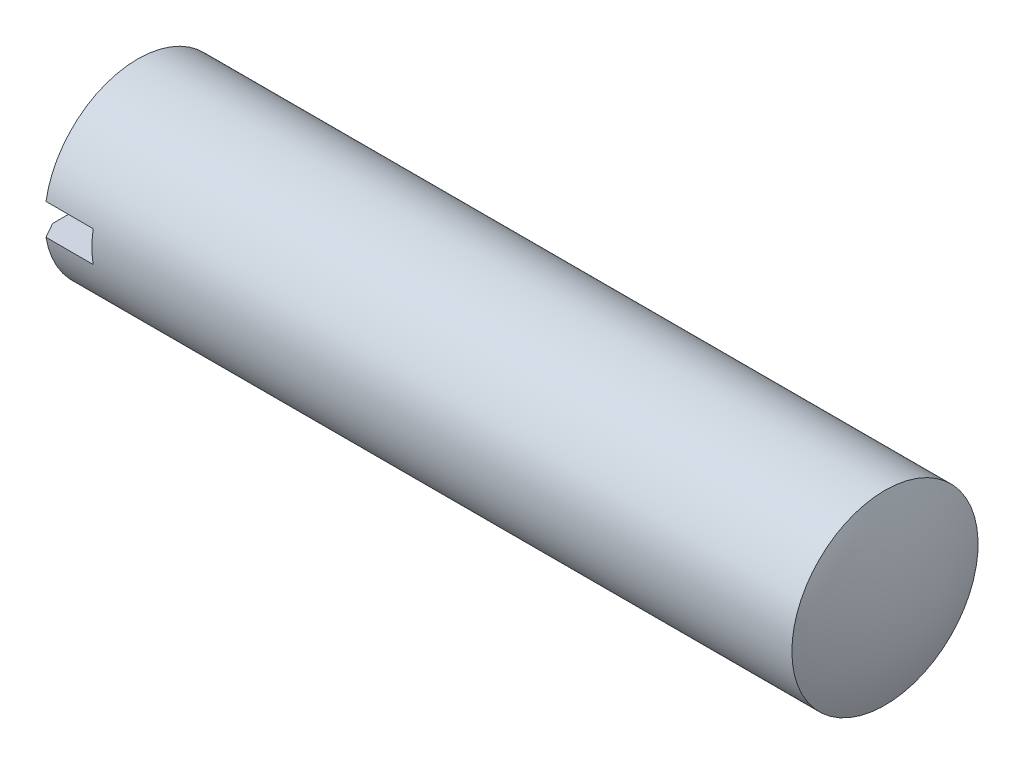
ISO-10303-21;
HEADER;
FILE_DESCRIPTION(('STEP AP214'),'2;1');
FILE_NAME('part.step','',(''),(''),'','','');
FILE_SCHEMA(('AUTOMOTIVE_DESIGN { 1 0 10303 214 1 1 1 1 }'));
ENDSEC;
DATA;
#1=APPLICATION_CONTEXT('core data for automotive mechanical design processes');
#2=APPLICATION_PROTOCOL_DEFINITION('international standard','automotive_design',2000,#1);
#3=PRODUCT_CONTEXT('',#1,'mechanical');
#4=PRODUCT('Part','Part','',(#3));
#5=PRODUCT_RELATED_PRODUCT_CATEGORY('part','',(#4));
#6=PRODUCT_DEFINITION_FORMATION('','',#4);
#7=PRODUCT_DEFINITION_CONTEXT('part definition',#1,'design');
#8=PRODUCT_DEFINITION('design','',#6,#7);
#9=PRODUCT_DEFINITION_SHAPE('','',#8);
#10=(LENGTH_UNIT() NAMED_UNIT(*) SI_UNIT(.MILLI.,.METRE.));
#11=(NAMED_UNIT(*) PLANE_ANGLE_UNIT() SI_UNIT($,.RADIAN.));
#12=(NAMED_UNIT(*) SI_UNIT($,.STERADIAN.) SOLID_ANGLE_UNIT());
#13=UNCERTAINTY_MEASURE_WITH_UNIT(LENGTH_MEASURE(1.E-05),#10,'distance_accuracy_value','');
#14=(GEOMETRIC_REPRESENTATION_CONTEXT(3) GLOBAL_UNCERTAINTY_ASSIGNED_CONTEXT((#13)) GLOBAL_UNIT_ASSIGNED_CONTEXT((#10,
#11,#12)) REPRESENTATION_CONTEXT('',''));
#15=CARTESIAN_POINT('',(0.,0.,0.));
#16=DIRECTION('',(0.,0.,1.));
#17=DIRECTION('',(1.,0.,0.));
#18=AXIS2_PLACEMENT_3D('',#15,#16,#17);
#19=CARTESIAN_POINT('',(0.,0.,0.));
#20=DIRECTION('',(-1.,0.,0.));
#21=DIRECTION('',(0.,0.,1.));
#22=AXIS2_PLACEMENT_3D('',#19,#20,#21);
#23=PLANE('',#22);
#24=CARTESIAN_POINT('',(0.,0.,0.));
#25=DIRECTION('',(-1.,0.,0.));
#26=DIRECTION('',(0.,0.,1.));
#27=AXIS2_PLACEMENT_3D('',#24,#25,#26);
#28=CIRCLE('',#27,5.036);
#29=CARTESIAN_POINT('',(0.,1.,4.93571636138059));
#30=VERTEX_POINT('',#29);
#31=CARTESIAN_POINT('',(0.,1.,-4.93571636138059));
#32=VERTEX_POINT('',#31);
#33=EDGE_CURVE('E108',#30,#32,#28,.T.);
#34=ORIENTED_EDGE('',*,*,#33,.T.);
#35=DIRECTION('',(0.,0.,1.));
#36=VECTOR('',#35,1.);
#37=CARTESIAN_POINT('',(0.,1.,-6.));
#38=LINE('',#37,#36);
#39=EDGE_CURVE('E172',#32,#30,#38,.T.);
#40=ORIENTED_EDGE('',*,*,#39,.T.);
#41=EDGE_LOOP('',(#34,#40));
#42=FACE_BOUND('',#41,.T.);
#43=ADVANCED_FACE('F35',(#42),#23,.T.);
#44=CARTESIAN_POINT('',(0.,-0.999999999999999,-4.93571636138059));
#45=VERTEX_POINT('',#44);
#46=CARTESIAN_POINT('',(0.,-1.,4.93571636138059));
#47=VERTEX_POINT('',#46);
#48=EDGE_CURVE('E104',#45,#47,#28,.T.);
#49=ORIENTED_EDGE('',*,*,#48,.T.);
#50=DIRECTION('',(0.,0.,-1.));
#51=VECTOR('',#50,1.);
#52=CARTESIAN_POINT('',(0.,-0.999999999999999,-6.));
#53=LINE('',#52,#51);
#54=EDGE_CURVE('E96',#47,#45,#53,.T.);
#55=ORIENTED_EDGE('',*,*,#54,.T.);
#56=EDGE_LOOP('',(#49,#55));
#57=FACE_BOUND('',#56,.T.);
#58=ADVANCED_FACE('F164',(#57),#23,.T.);
#59=CARTESIAN_POINT('',(0.,0.,0.));
#60=DIRECTION('',(1.,0.,0.));
#61=DIRECTION('',(0.,0.,-1.));
#62=AXIS2_PLACEMENT_3D('',#59,#60,#61);
#63=CONICAL_SURFACE('',#62,5.036,1.0471975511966);
#64=CARTESIAN_POINT('',(0.5565656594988,0.,0.));
#65=DIRECTION('',(-1.,0.,0.));
#66=DIRECTION('',(0.,0.,1.));
#67=AXIS2_PLACEMENT_3D('',#64,#65,#66);
#68=CIRCLE('',#67,6.);
#69=CARTESIAN_POINT('',(0.5565656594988,0.999999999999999,5.91607978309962));
#70=VERTEX_POINT('',#69);
#71=CARTESIAN_POINT('',(0.5565656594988,1.,-5.91607978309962));
#72=VERTEX_POINT('',#71);
#73=EDGE_CURVE('E101',#70,#72,#68,.T.);
#74=ORIENTED_EDGE('',*,*,#73,.T.);
#75=CARTESIAN_POINT('',(4.73989669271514,1.,-13.2079399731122));
#76=CARTESIAN_POINT('',(4.41853771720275,1.,-12.6497082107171));
#77=CARTESIAN_POINT('',(4.09724308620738,1.,-12.0914392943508));
#78=CARTESIAN_POINT('',(3.45491866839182,1.,-10.9747439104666));
#79=CARTESIAN_POINT('',(3.13388888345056,1.,-10.416317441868));
#80=CARTESIAN_POINT('',(2.49197762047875,1.,-9.29878375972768));
#81=CARTESIAN_POINT('',(2.17109646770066,1.,-8.73967635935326));
#82=CARTESIAN_POINT('',(1.53002759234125,1.,-7.62106803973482));
#83=CARTESIAN_POINT('',(1.2098398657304,1.,-7.0615671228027));
#84=CARTESIAN_POINT('',(0.731752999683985,1.,-6.22374471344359));
#85=CARTESIAN_POINT('',(0.573331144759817,1.,-5.94572157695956));
#86=CARTESIAN_POINT('',(0.25700680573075,1.,-5.38937510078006));
#87=CARTESIAN_POINT('',(0.0991043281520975,1.,-5.11105175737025));
#88=CARTESIAN_POINT('',(-0.215803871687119,1.,-4.5540578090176));
#89=CARTESIAN_POINT('',(-0.372809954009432,1.,-4.27538740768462));
#90=CARTESIAN_POINT('',(-0.685421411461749,1.,-3.71727146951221));
#91=CARTESIAN_POINT('',(-0.841026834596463,1.,-3.43782595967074));
#92=CARTESIAN_POINT('',(-1.07280047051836,1.,-3.01670739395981));
#93=CARTESIAN_POINT('',(-1.15000341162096,1.,-2.87560489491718));
#94=CARTESIAN_POINT('',(-1.30334590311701,1.,-2.59280771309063));
#95=CARTESIAN_POINT('',(-1.37948536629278,1.,-2.45111298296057));
#96=CARTESIAN_POINT('',(-1.53019389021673,1.,-2.16666998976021));
#97=CARTESIAN_POINT('',(-1.60476099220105,1.,-2.02392068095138));
#98=CARTESIAN_POINT('',(-1.71445658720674,1.,-1.80870871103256));
#99=CARTESIAN_POINT('',(-1.75066016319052,1.,-1.73679509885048));
#100=CARTESIAN_POINT('',(-1.82208482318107,1.,-1.59248261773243));
#101=CARTESIAN_POINT('',(-1.85730593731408,1.,-1.52008376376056));
#102=CARTESIAN_POINT('',(-1.92735529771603,1.,-1.37261463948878));
#103=CARTESIAN_POINT('',(-1.96214530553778,1.,-1.29752611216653));
#104=CARTESIAN_POINT('',(-2.02965956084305,1.,-1.1464272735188));
#105=CARTESIAN_POINT('',(-2.06238404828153,1.,-1.07041707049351));
#106=CARTESIAN_POINT('',(-2.12476431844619,1.,-0.917145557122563));
#107=CARTESIAN_POINT('',(-2.15442052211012,1.,-0.83988442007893));
#108=CARTESIAN_POINT('',(-2.20906255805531,1.,-0.683706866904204));
#109=CARTESIAN_POINT('',(-2.23405029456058,1.,-0.604791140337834));
#110=CARTESIAN_POINT('',(-2.2701858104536,1.,-0.470093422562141));
#111=CARTESIAN_POINT('',(-2.28321589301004,1.,-0.414824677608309));
#112=CARTESIAN_POINT('',(-2.3049462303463,1.,-0.303453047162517));
#113=CARTESIAN_POINT('',(-2.31364920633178,1.,-0.247350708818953));
#114=CARTESIAN_POINT('',(-2.32581520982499,1.,-0.134957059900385));
#115=CARTESIAN_POINT('',(-2.32931440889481,1.,-0.0786698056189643));
#116=CARTESIAN_POINT('',(-2.33076867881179,1.,0.0339758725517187));
#117=CARTESIAN_POINT('',(-2.32872385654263,1.,0.0903342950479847));
#118=CARTESIAN_POINT('',(-2.31805799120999,1.,0.217768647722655));
#119=CARTESIAN_POINT('',(-2.30780921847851,1.,0.288706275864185));
#120=CARTESIAN_POINT('',(-2.28041448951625,1.,0.429255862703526));
#121=CARTESIAN_POINT('',(-2.26326048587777,1.,0.498866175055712));
#122=CARTESIAN_POINT('',(-2.2336732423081,1.,0.602653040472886));
#123=CARTESIAN_POINT('',(-2.22308279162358,1.,0.637377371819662));
#124=CARTESIAN_POINT('',(-2.20083833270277,1.,0.706460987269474));
#125=CARTESIAN_POINT('',(-2.18918499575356,1.,0.740820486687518));
#126=CARTESIAN_POINT('',(-2.16499431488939,1.,0.809218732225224));
#127=CARTESIAN_POINT('',(-2.15245710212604,1.,0.843257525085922));
#128=CARTESIAN_POINT('',(-2.12664333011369,1.,0.911058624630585));
#129=CARTESIAN_POINT('',(-2.11336665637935,1.,0.944820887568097));
#130=CARTESIAN_POINT('',(-2.06998388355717,1.,1.05227293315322));
#131=CARTESIAN_POINT('',(-2.03871498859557,1.,1.1254929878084));
#132=CARTESIAN_POINT('',(-1.97418773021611,1.,1.27105481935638));
#133=CARTESIAN_POINT('',(-1.94092900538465,1.,1.34339643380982));
#134=CARTESIAN_POINT('',(-1.87300145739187,1.,1.48745172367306));
#135=CARTESIAN_POINT('',(-1.83833201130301,1.,1.55916510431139));
#136=CARTESIAN_POINT('',(-1.76798292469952,1.,1.7020957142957));
#137=CARTESIAN_POINT('',(-1.73230324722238,1.,1.77331292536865));
#138=CARTESIAN_POINT('',(-1.62404833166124,1.,1.98662313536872));
#139=CARTESIAN_POINT('',(-1.55036430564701,1.,2.12815237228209));
#140=CARTESIAN_POINT('',(-1.40130813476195,1.,2.41025810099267));
#141=CARTESIAN_POINT('',(-1.32593649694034,1.,2.55083486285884));
#142=CARTESIAN_POINT('',(-1.17450983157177,1.,2.83063597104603));
#143=CARTESIAN_POINT('',(-1.0984607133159,1.,2.96986351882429));
#144=CARTESIAN_POINT('',(-0.945628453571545,1.,3.24792809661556));
#145=CARTESIAN_POINT('',(-0.868845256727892,1.,3.38676509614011));
#146=CARTESIAN_POINT('',(-0.637891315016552,1.,3.80258527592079));
#147=CARTESIAN_POINT('',(-0.482967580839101,1.,4.07914988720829));
#148=CARTESIAN_POINT('',(-0.119566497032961,1.,4.72494312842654));
#149=CARTESIAN_POINT('',(0.0893330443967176,0.999999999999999,5.09393352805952));
#150=CARTESIAN_POINT('',(0.50813116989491,0.999999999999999,5.8313517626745));
#151=CARTESIAN_POINT('',(0.718029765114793,0.999999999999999,6.1997795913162));
#152=CARTESIAN_POINT('',(1.13850339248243,0.999999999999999,6.93645171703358));
#153=CARTESIAN_POINT('',(1.34907866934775,0.999999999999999,7.30469587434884));
#154=CARTESIAN_POINT('',(1.77060223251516,0.999999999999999,8.04096877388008));
#155=CARTESIAN_POINT('',(1.98155051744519,0.999999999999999,8.40899751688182));
#156=CARTESIAN_POINT('',(2.40459995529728,0.999999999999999,9.14648067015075));
#157=CARTESIAN_POINT('',(2.61670218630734,0.999999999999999,9.51593446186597));
#158=CARTESIAN_POINT('',(3.04108596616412,0.999999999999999,10.2547396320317));
#159=CARTESIAN_POINT('',(3.25336751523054,0.999999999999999,10.624091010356));
#160=CARTESIAN_POINT('',(3.67796813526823,0.999999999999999,11.3625576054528));
#161=CARTESIAN_POINT('',(3.8902871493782,0.999999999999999,11.7316728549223));
#162=CARTESIAN_POINT('',(4.31502474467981,0.999999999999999,12.4698454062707));
#163=CARTESIAN_POINT('',(4.52744332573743,0.999999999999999,12.8389027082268));
#164=CARTESIAN_POINT('',(4.73989669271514,0.999999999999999,13.2079399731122));
#165=B_SPLINE_CURVE_WITH_KNOTS('',3,(#75,#76,#77,#78,#79,#80,#81,#82,#83,#84,#85,#86,#87,#88,
#89,#90,#91,#92,#93,#94,#95,#96,#97,#98,#99,#100,#101,#102,#103,#104,#105,#106,#107,#108,#109,
#110,#111,#112,#113,#114,#115,#116,#117,#118,#119,#120,#121,#122,#123,#124,#125,#126,#127,#128,
#129,#130,#131,#132,#133,#134,#135,#136,#137,#138,#139,#140,#141,#142,#143,#144,#145,#146,#147,
#148,#149,#150,#151,#152,#153,#154,#155,#156,#157,#158,#159,#160,#161,#162,#163,#164),
.UNSPECIFIED.,.F.,.F.,(4,2,2,2,2,2,2,2,2,2,2,2,2,2,2,2,2,2,2,2,2,2,2,2,2,2,2,2,2,2,2,2,2,2,2,2,
2,2,2,2,2,2,2,2,4),(0.,1.93236881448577,3.86475122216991,5.79868288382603,7.73260327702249,
8.69257649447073,9.65256172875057,10.612129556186,11.5716643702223,12.054187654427,
12.5367502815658,13.019882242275,13.2614145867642,13.5029395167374,13.7511887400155,
13.9994090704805,14.2475953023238,14.4956800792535,14.6658994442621,14.8360116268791,
15.0049357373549,15.1738565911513,15.3884236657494,15.6032415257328,15.7121389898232,
15.8209681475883,15.9297811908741,16.0386111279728,16.2774120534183,16.5162564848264,
16.7552075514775,16.9941673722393,17.4728272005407,17.9513450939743,18.4272722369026,
18.903235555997,19.8542316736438,21.1262890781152,22.3983607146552,23.6709606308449,
24.943555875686,26.2215820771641,27.4996098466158,28.7770795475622,30.0545475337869),.UNSPECIFIED.);
#166=EDGE_CURVE('E129',#72,#32,#165,.T.);
#167=ORIENTED_EDGE('',*,*,#166,.T.);
#168=ORIENTED_EDGE('',*,*,#33,.F.);
#169=EDGE_CURVE('E131',#30,#70,#165,.T.);
#170=ORIENTED_EDGE('',*,*,#169,.T.);
#171=EDGE_LOOP('',(#74,#167,#168,#170));
#172=FACE_BOUND('',#171,.T.);
#173=ADVANCED_FACE('F144',(#172),#63,.T.);
#174=CARTESIAN_POINT('',(0.5565656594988,-0.999999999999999,-5.91607978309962));
#175=VERTEX_POINT('',#174);
#176=CARTESIAN_POINT('',(0.5565656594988,-1.,5.91607978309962));
#177=VERTEX_POINT('',#176);
#178=EDGE_CURVE('E105',#175,#177,#68,.T.);
#179=ORIENTED_EDGE('',*,*,#178,.T.);
#180=CARTESIAN_POINT('',(4.73989669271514,-1.,13.2079399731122));
#181=CARTESIAN_POINT('',(4.41853771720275,-1.,12.649708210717));
#182=CARTESIAN_POINT('',(4.09724308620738,-1.,12.0914392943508));
#183=CARTESIAN_POINT('',(3.45491866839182,-1.,10.9747439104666));
#184=CARTESIAN_POINT('',(3.13388888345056,-1.,10.416317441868));
#185=CARTESIAN_POINT('',(2.49197762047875,-1.,9.29878375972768));
#186=CARTESIAN_POINT('',(2.17109646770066,-1.,8.73967635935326));
#187=CARTESIAN_POINT('',(1.53002759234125,-1.,7.62106803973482));
#188=CARTESIAN_POINT('',(1.2098398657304,-1.,7.0615671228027));
#189=CARTESIAN_POINT('',(0.731752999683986,-1.,6.2237447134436));
#190=CARTESIAN_POINT('',(0.573331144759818,-1.,5.94572157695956));
#191=CARTESIAN_POINT('',(0.257006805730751,-1.,5.38937510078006));
#192=CARTESIAN_POINT('',(0.0991043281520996,-1.,5.11105175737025));
#193=CARTESIAN_POINT('',(-0.215803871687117,-1.,4.55405780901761));
#194=CARTESIAN_POINT('',(-0.372809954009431,-1.,4.27538740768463));
#195=CARTESIAN_POINT('',(-0.685421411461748,-1.,3.71727146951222));
#196=CARTESIAN_POINT('',(-0.841026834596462,-1.,3.43782595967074));
#197=CARTESIAN_POINT('',(-1.07280047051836,-1.,3.01670739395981));
#198=CARTESIAN_POINT('',(-1.15000341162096,-1.,2.87560489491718));
#199=CARTESIAN_POINT('',(-1.30334590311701,-1.,2.59280771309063));
#200=CARTESIAN_POINT('',(-1.37948536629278,-1.,2.45111298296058));
#201=CARTESIAN_POINT('',(-1.53019389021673,-1.,2.16666998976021));
#202=CARTESIAN_POINT('',(-1.60476099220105,-1.,2.02392068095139));
#203=CARTESIAN_POINT('',(-1.71445658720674,-1.,1.80870871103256));
#204=CARTESIAN_POINT('',(-1.75066016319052,-1.,1.73679509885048));
#205=CARTESIAN_POINT('',(-1.82208482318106,-1.,1.59248261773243));
#206=CARTESIAN_POINT('',(-1.85730593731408,-1.,1.52008376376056));
#207=CARTESIAN_POINT('',(-1.92735529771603,-1.,1.37261463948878));
#208=CARTESIAN_POINT('',(-1.96214530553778,-1.,1.29752611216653));
#209=CARTESIAN_POINT('',(-2.02965956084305,-1.,1.1464272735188));
#210=CARTESIAN_POINT('',(-2.06238404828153,-1.,1.07041707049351));
#211=CARTESIAN_POINT('',(-2.12476431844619,-1.,0.917145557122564));
#212=CARTESIAN_POINT('',(-2.15442052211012,-1.,0.839884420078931));
#213=CARTESIAN_POINT('',(-2.2090625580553,-1.,0.683706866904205));
#214=CARTESIAN_POINT('',(-2.23405029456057,-1.,0.604791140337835));
#215=CARTESIAN_POINT('',(-2.2701858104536,-1.,0.470093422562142));
#216=CARTESIAN_POINT('',(-2.28321589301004,-1.,0.41482467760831));
#217=CARTESIAN_POINT('',(-2.3049462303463,-1.,0.303453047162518));
#218=CARTESIAN_POINT('',(-2.31364920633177,-1.,0.247350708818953));
#219=CARTESIAN_POINT('',(-2.32581520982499,-1.,0.134957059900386));
#220=CARTESIAN_POINT('',(-2.32931440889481,-1.,0.0786698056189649));
#221=CARTESIAN_POINT('',(-2.33076867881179,-1.,-0.0339758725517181));
#222=CARTESIAN_POINT('',(-2.32872385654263,-1.,-0.0903342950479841));
#223=CARTESIAN_POINT('',(-2.31805799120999,-1.,-0.217768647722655));
#224=CARTESIAN_POINT('',(-2.30780921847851,-1.,-0.288706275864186));
#225=CARTESIAN_POINT('',(-2.28041448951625,-1.,-0.429255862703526));
#226=CARTESIAN_POINT('',(-2.26326048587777,-1.,-0.498866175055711));
#227=CARTESIAN_POINT('',(-2.2336732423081,-1.,-0.602653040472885));
#228=CARTESIAN_POINT('',(-2.22308279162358,-1.,-0.637377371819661));
#229=CARTESIAN_POINT('',(-2.20083833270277,-1.,-0.706460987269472));
#230=CARTESIAN_POINT('',(-2.18918499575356,-1.,-0.740820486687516));
#231=CARTESIAN_POINT('',(-2.16499431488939,-1.,-0.809218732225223));
#232=CARTESIAN_POINT('',(-2.15245710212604,-1.,-0.843257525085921));
#233=CARTESIAN_POINT('',(-2.12664333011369,-1.,-0.911058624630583));
#234=CARTESIAN_POINT('',(-2.11336665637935,-1.,-0.944820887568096));
#235=CARTESIAN_POINT('',(-2.06998388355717,-1.,-1.05227293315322));
#236=CARTESIAN_POINT('',(-2.03871498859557,-1.,-1.12549298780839));
#237=CARTESIAN_POINT('',(-1.97418773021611,-1.,-1.27105481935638));
#238=CARTESIAN_POINT('',(-1.94092900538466,-1.,-1.34339643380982));
#239=CARTESIAN_POINT('',(-1.87300145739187,-1.,-1.48745172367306));
#240=CARTESIAN_POINT('',(-1.83833201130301,-1.,-1.55916510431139));
#241=CARTESIAN_POINT('',(-1.76798292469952,-1.,-1.7020957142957));
#242=CARTESIAN_POINT('',(-1.73230324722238,-1.,-1.77331292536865));
#243=CARTESIAN_POINT('',(-1.62404833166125,-1.,-1.98662313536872));
#244=CARTESIAN_POINT('',(-1.55036430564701,-1.,-2.12815237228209));
#245=CARTESIAN_POINT('',(-1.40130813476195,-1.,-2.41025810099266));
#246=CARTESIAN_POINT('',(-1.32593649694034,-1.,-2.55083486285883));
#247=CARTESIAN_POINT('',(-1.17450983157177,-1.,-2.83063597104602));
#248=CARTESIAN_POINT('',(-1.09846071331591,-1.,-2.96986351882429));
#249=CARTESIAN_POINT('',(-0.945628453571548,-1.,-3.24792809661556));
#250=CARTESIAN_POINT('',(-0.868845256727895,-1.,-3.3867650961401));
#251=CARTESIAN_POINT('',(-0.637891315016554,-0.999999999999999,-3.80258527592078));
#252=CARTESIAN_POINT('',(-0.482967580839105,-1.,-4.07914988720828));
#253=CARTESIAN_POINT('',(-0.119566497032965,-1.,-4.72494312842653));
#254=CARTESIAN_POINT('',(0.0893330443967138,-0.999999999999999,-5.09393352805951));
#255=CARTESIAN_POINT('',(0.508131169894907,-0.999999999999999,-5.83135176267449));
#256=CARTESIAN_POINT('',(0.718029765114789,-0.999999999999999,-6.1997795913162));
#257=CARTESIAN_POINT('',(1.13850339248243,-0.999999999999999,-6.93645171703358));
#258=CARTESIAN_POINT('',(1.34907866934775,-0.999999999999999,-7.30469587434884));
#259=CARTESIAN_POINT('',(1.77060223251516,-0.999999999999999,-8.04096877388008));
#260=CARTESIAN_POINT('',(1.98155051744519,-0.999999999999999,-8.40899751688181));
#261=CARTESIAN_POINT('',(2.40459995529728,-0.999999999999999,-9.14648067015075));
#262=CARTESIAN_POINT('',(2.61670218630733,-0.999999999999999,-9.51593446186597));
#263=CARTESIAN_POINT('',(3.04108596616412,-0.999999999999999,-10.2547396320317));
#264=CARTESIAN_POINT('',(3.25336751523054,-0.999999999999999,-10.624091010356));
#265=CARTESIAN_POINT('',(3.67796813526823,-0.999999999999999,-11.3625576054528));
#266=CARTESIAN_POINT('',(3.8902871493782,-0.999999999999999,-11.7316728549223));
#267=CARTESIAN_POINT('',(4.31502474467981,-0.999999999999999,-12.4698454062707));
#268=CARTESIAN_POINT('',(4.52744332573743,-0.999999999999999,-12.8389027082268));
#269=CARTESIAN_POINT('',(4.73989669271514,-0.999999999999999,-13.2079399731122));
#270=B_SPLINE_CURVE_WITH_KNOTS('',3,(#180,#181,#182,#183,#184,#185,#186,#187,#188,#189,#190,
#191,#192,#193,#194,#195,#196,#197,#198,#199,#200,#201,#202,#203,#204,#205,#206,#207,#208,#209,
#210,#211,#212,#213,#214,#215,#216,#217,#218,#219,#220,#221,#222,#223,#224,#225,#226,#227,#228,
#229,#230,#231,#232,#233,#234,#235,#236,#237,#238,#239,#240,#241,#242,#243,#244,#245,#246,#247,
#248,#249,#250,#251,#252,#253,#254,#255,#256,#257,#258,#259,#260,#261,#262,#263,#264,#265,#266,
#267,#268,#269),.UNSPECIFIED.,.F.,.F.,(4,2,2,2,2,2,2,2,2,2,2,2,2,2,2,2,2,2,2,2,2,2,2,2,2,2,2,2,
2,2,2,2,2,2,2,2,2,2,2,2,2,2,2,2,4),(0.,1.93236881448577,3.86475122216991,5.79868288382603,
7.73260327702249,8.69257649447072,9.65256172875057,10.612129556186,11.5716643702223,
12.054187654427,12.5367502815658,13.019882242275,13.2614145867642,13.5029395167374,
13.7511887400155,13.9994090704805,14.2475953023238,14.4956800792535,14.6658994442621,
14.8360116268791,15.0049357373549,15.1738565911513,15.3884236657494,15.6032415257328,
15.7121389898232,15.8209681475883,15.9297811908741,16.0386111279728,16.2774120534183,
16.5162564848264,16.7552075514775,16.9941673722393,17.4728272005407,17.9513450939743,
18.4272722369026,18.903235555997,19.8542316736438,21.1262890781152,22.3983607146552,
23.6709606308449,24.943555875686,26.2215820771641,27.4996098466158,28.7770795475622,
30.0545475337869),.UNSPECIFIED.);
#271=EDGE_CURVE('E126',#177,#47,#270,.T.);
#272=ORIENTED_EDGE('',*,*,#271,.T.);
#273=ORIENTED_EDGE('',*,*,#48,.F.);
#274=EDGE_CURVE('E127',#45,#175,#270,.T.);
#275=ORIENTED_EDGE('',*,*,#274,.T.);
#276=EDGE_LOOP('',(#179,#272,#273,#275));
#277=FACE_BOUND('',#276,.T.);
#278=ADVANCED_FACE('F124',(#277),#63,.T.);
#279=CARTESIAN_POINT('',(-12.7,0.,0.));
#280=DIRECTION('',(-1.,0.,0.));
#281=DIRECTION('',(0.,0.,1.));
#282=AXIS2_PLACEMENT_3D('',#279,#280,#281);
#283=CYLINDRICAL_SURFACE('',#282,6.);
#284=CARTESIAN_POINT('',(48.7114574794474,0.,0.));
#285=DIRECTION('',(-1.,0.,0.));
#286=DIRECTION('',(0.,0.,1.));
#287=AXIS2_PLACEMENT_3D('',#284,#285,#286);
#288=CIRCLE('',#287,6.);
#289=CARTESIAN_POINT('',(48.7114574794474,0.,6.));
#290=VERTEX_POINT('',#289);
#291=EDGE_CURVE('E111',#290,#290,#288,.T.);
#292=ORIENTED_EDGE('',*,*,#291,.T.);
#293=EDGE_LOOP('',(#292));
#294=FACE_BOUND('',#293,.T.);
#295=ORIENTED_EDGE('',*,*,#73,.F.);
#296=DIRECTION('',(-1.,0.,0.));
#297=VECTOR('',#296,1.);
#298=CARTESIAN_POINT('',(-12.7,0.999999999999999,5.91607978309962));
#299=LINE('',#298,#297);
#300=CARTESIAN_POINT('',(3.6,0.999999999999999,5.91607978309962));
#301=VERTEX_POINT('',#300);
#302=EDGE_CURVE('E11',#70,#301,#299,.F.);
#303=ORIENTED_EDGE('',*,*,#302,.T.);
#304=CARTESIAN_POINT('',(3.6,0.,0.));
#305=DIRECTION('',(1.,0.,0.));
#306=DIRECTION('',(0.,0.,-1.));
#307=AXIS2_PLACEMENT_3D('',#304,#305,#306);
#308=CIRCLE('',#307,6.);
#309=CARTESIAN_POINT('',(3.6,-1.,5.91607978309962));
#310=VERTEX_POINT('',#309);
#311=EDGE_CURVE('E83',#310,#301,#308,.F.);
#312=ORIENTED_EDGE('',*,*,#311,.F.);
#313=DIRECTION('',(-1.,0.,0.));
#314=VECTOR('',#313,1.);
#315=CARTESIAN_POINT('',(-12.7,-1.,5.91607978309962));
#316=LINE('',#315,#314);
#317=EDGE_CURVE('E42',#310,#177,#316,.T.);
#318=ORIENTED_EDGE('',*,*,#317,.T.);
#319=ORIENTED_EDGE('',*,*,#178,.F.);
#320=DIRECTION('',(-1.,0.,0.));
#321=VECTOR('',#320,1.);
#322=CARTESIAN_POINT('',(-12.7,-0.999999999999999,-5.91607978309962));
#323=LINE('',#322,#321);
#324=CARTESIAN_POINT('',(3.6,-0.999999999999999,-5.91607978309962));
#325=VERTEX_POINT('',#324);
#326=EDGE_CURVE('E116',#175,#325,#323,.F.);
#327=ORIENTED_EDGE('',*,*,#326,.T.);
#328=CARTESIAN_POINT('',(3.6,1.,-5.91607978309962));
#329=VERTEX_POINT('',#328);
#330=EDGE_CURVE('E92',#329,#325,#308,.F.);
#331=ORIENTED_EDGE('',*,*,#330,.F.);
#332=DIRECTION('',(-1.,0.,0.));
#333=VECTOR('',#332,1.);
#334=CARTESIAN_POINT('',(-12.7,1.,-5.91607978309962));
#335=LINE('',#334,#333);
#336=EDGE_CURVE('E90',#329,#72,#335,.T.);
#337=ORIENTED_EDGE('',*,*,#336,.T.);
#338=EDGE_LOOP('',(#295,#303,#312,#318,#319,#327,#331,#337));
#339=FACE_BOUND('',#338,.T.);
#340=ADVANCED_FACE('F99',(#294,#339),#283,.T.);
#341=CARTESIAN_POINT('',(35.3864574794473,0.,0.));
#342=DIRECTION('',(-1.,0.,0.));
#343=DIRECTION('',(0.,1.,0.));
#344=AXIS2_PLACEMENT_3D('',#341,#342,#343);
#345=SPHERICAL_SURFACE('',#344,14.6135425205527);
#346=ORIENTED_EDGE('',*,*,#291,.F.);
#347=EDGE_LOOP('',(#346));
#348=FACE_BOUND('',#347,.T.);
#349=ADVANCED_FACE('F154',(#348),#345,.T.);
#350=CARTESIAN_POINT('',(3.6,1.,-6.));
#351=DIRECTION('',(0.,-1.,0.));
#352=DIRECTION('',(0.,0.,-1.));
#353=AXIS2_PLACEMENT_3D('',#350,#351,#352);
#354=PLANE('',#353);
#355=ORIENTED_EDGE('',*,*,#39,.F.);
#356=ORIENTED_EDGE('',*,*,#166,.F.);
#357=ORIENTED_EDGE('',*,*,#336,.F.);
#358=DIRECTION('',(0.,0.,1.));
#359=VECTOR('',#358,1.);
#360=CARTESIAN_POINT('',(3.6,1.,-6.));
#361=LINE('',#360,#359);
#362=EDGE_CURVE('E49',#329,#301,#361,.T.);
#363=ORIENTED_EDGE('',*,*,#362,.T.);
#364=ORIENTED_EDGE('',*,*,#302,.F.);
#365=ORIENTED_EDGE('',*,*,#169,.F.);
#366=EDGE_LOOP('',(#355,#356,#357,#363,#364,#365));
#367=FACE_BOUND('',#366,.T.);
#368=ADVANCED_FACE('F93',(#367),#354,.T.);
#369=CARTESIAN_POINT('',(3.6,-0.999999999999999,-6.));
#370=DIRECTION('',(0.,1.,0.));
#371=DIRECTION('',(0.,0.,1.));
#372=AXIS2_PLACEMENT_3D('',#369,#370,#371);
#373=PLANE('',#372);
#374=ORIENTED_EDGE('',*,*,#54,.F.);
#375=ORIENTED_EDGE('',*,*,#271,.F.);
#376=ORIENTED_EDGE('',*,*,#317,.F.);
#377=DIRECTION('',(0.,0.,-1.));
#378=VECTOR('',#377,1.);
#379=CARTESIAN_POINT('',(3.6,-0.999999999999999,-6.));
#380=LINE('',#379,#378);
#381=EDGE_CURVE('E86',#310,#325,#380,.T.);
#382=ORIENTED_EDGE('',*,*,#381,.T.);
#383=ORIENTED_EDGE('',*,*,#326,.F.);
#384=ORIENTED_EDGE('',*,*,#274,.F.);
#385=EDGE_LOOP('',(#374,#375,#376,#382,#383,#384));
#386=FACE_BOUND('',#385,.T.);
#387=ADVANCED_FACE('F147',(#386),#373,.T.);
#388=CARTESIAN_POINT('',(3.6,1.,-6.));
#389=DIRECTION('',(1.,0.,0.));
#390=DIRECTION('',(0.,0.,-1.));
#391=AXIS2_PLACEMENT_3D('',#388,#389,#390);
#392=PLANE('',#391);
#393=ORIENTED_EDGE('',*,*,#381,.F.);
#394=ORIENTED_EDGE('',*,*,#311,.T.);
#395=ORIENTED_EDGE('',*,*,#362,.F.);
#396=ORIENTED_EDGE('',*,*,#330,.T.);
#397=EDGE_LOOP('',(#393,#394,#395,#396));
#398=FACE_BOUND('',#397,.T.);
#399=ADVANCED_FACE('F84',(#398),#392,.F.);
#400=CLOSED_SHELL('',(#43,#58,#173,#278,#340,#349,#368,#387,#399));
#401=MANIFOLD_SOLID_BREP('B2',#400);
#402=ADVANCED_BREP_SHAPE_REPRESENTATION('',(#18,#401),#14);
#403=SHAPE_DEFINITION_REPRESENTATION(#9,#402);
ENDSEC;
END-ISO-10303-21;
